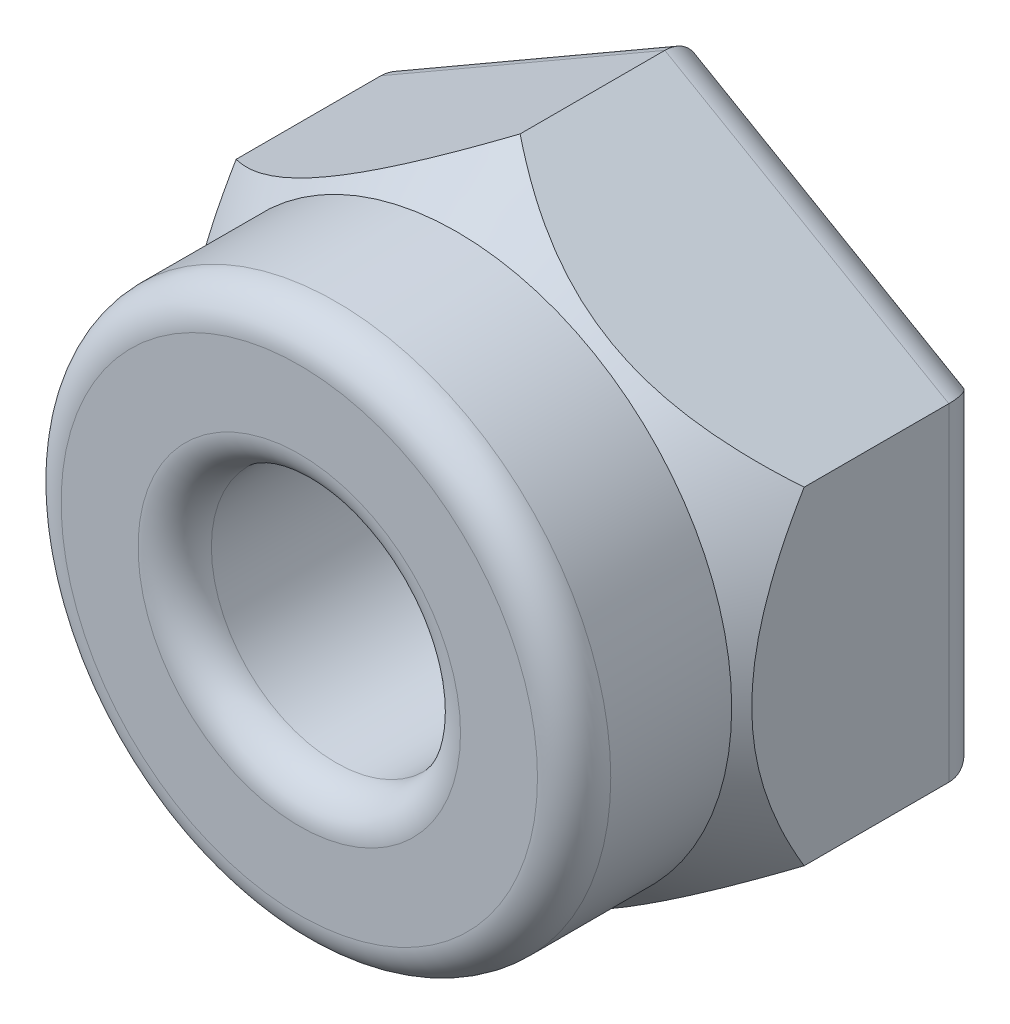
ISO-10303-21;
HEADER;
FILE_DESCRIPTION(('STEP AP214'),'2;1');
FILE_NAME('part.step','',(''),(''),'','','');
FILE_SCHEMA(('AUTOMOTIVE_DESIGN { 1 0 10303 214 1 1 1 1 }'));
ENDSEC;
DATA;
#1=APPLICATION_CONTEXT('core data for automotive mechanical design processes');
#2=APPLICATION_PROTOCOL_DEFINITION('international standard','automotive_design',2000,#1);
#3=PRODUCT_CONTEXT('',#1,'mechanical');
#4=PRODUCT('Part','Part','',(#3));
#5=PRODUCT_RELATED_PRODUCT_CATEGORY('part','',(#4));
#6=PRODUCT_DEFINITION_FORMATION('','',#4);
#7=PRODUCT_DEFINITION_CONTEXT('part definition',#1,'design');
#8=PRODUCT_DEFINITION('design','',#6,#7);
#9=PRODUCT_DEFINITION_SHAPE('','',#8);
#10=(LENGTH_UNIT() NAMED_UNIT(*) SI_UNIT(.MILLI.,.METRE.));
#11=(NAMED_UNIT(*) PLANE_ANGLE_UNIT() SI_UNIT($,.RADIAN.));
#12=(NAMED_UNIT(*) SI_UNIT($,.STERADIAN.) SOLID_ANGLE_UNIT());
#13=UNCERTAINTY_MEASURE_WITH_UNIT(LENGTH_MEASURE(1.E-05),#10,'distance_accuracy_value','');
#14=(GEOMETRIC_REPRESENTATION_CONTEXT(3) GLOBAL_UNCERTAINTY_ASSIGNED_CONTEXT((#13)) GLOBAL_UNIT_ASSIGNED_CONTEXT((#10,
#11,#12)) REPRESENTATION_CONTEXT('',''));
#15=CARTESIAN_POINT('',(0.,0.,0.));
#16=DIRECTION('',(0.,0.,1.));
#17=DIRECTION('',(1.,0.,0.));
#18=AXIS2_PLACEMENT_3D('',#15,#16,#17);
#19=CARTESIAN_POINT('',(-3.937,-2.27302800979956,3.3909));
#20=DIRECTION('',(0.5,0.866025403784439,0.));
#21=DIRECTION('',(-0.866025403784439,0.5,0.));
#22=AXIS2_PLACEMENT_3D('',#19,#20,#21);
#23=PLANE('',#22);
#24=DIRECTION('',(0.,0.,-1.));
#25=VECTOR('',#24,1.);
#26=CARTESIAN_POINT('',(-3.937,-2.27302800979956,3.3909));
#27=LINE('',#26,#25);
#28=CARTESIAN_POINT('',(-3.937,-2.27302800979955,2.51370259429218));
#29=VERTEX_POINT('',#28);
#30=CARTESIAN_POINT('',(-3.937,-2.27302800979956,0.508000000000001));
#31=VERTEX_POINT('',#30);
#32=EDGE_CURVE('E293',#29,#31,#27,.T.);
#33=ORIENTED_EDGE('',*,*,#32,.T.);
#34=DIRECTION('',(0.866025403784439,-0.5,0.));
#35=VECTOR('',#34,1.);
#36=CARTESIAN_POINT('',(-3.937,-2.27302800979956,0.508));
#37=LINE('',#36,#35);
#38=CARTESIAN_POINT('',(0.,-4.54605601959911,0.508000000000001));
#39=VERTEX_POINT('',#38);
#40=EDGE_CURVE('E169',#31,#39,#37,.T.);
#41=ORIENTED_EDGE('',*,*,#40,.T.);
#42=DIRECTION('',(0.,0.,-1.));
#43=VECTOR('',#42,1.);
#44=CARTESIAN_POINT('',(0.,-4.54605601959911,3.3909));
#45=LINE('',#44,#43);
#46=CARTESIAN_POINT('',(0.,-4.54605601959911,2.51370259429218));
#47=VERTEX_POINT('',#46);
#48=EDGE_CURVE('E131',#47,#39,#45,.T.);
#49=ORIENTED_EDGE('',*,*,#48,.F.);
#50=CARTESIAN_POINT('',(-3.9372,-2.27291253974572,2.51356497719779));
#51=CARTESIAN_POINT('',(-3.87918851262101,-2.30640548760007,2.55347726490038));
#52=CARTESIAN_POINT('',(-3.82067869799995,-2.34018614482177,2.59242168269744));
#53=CARTESIAN_POINT('',(-3.70255594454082,-2.40838434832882,2.66808684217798));
#54=CARTESIAN_POINT('',(-3.64294249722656,-2.44280218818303,2.70480652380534));
#55=CARTESIAN_POINT('',(-3.46164394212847,-2.54747495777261,2.8115681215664));
#56=CARTESIAN_POINT('',(-3.33819856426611,-2.61874617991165,2.87772345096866));
#57=CARTESIAN_POINT('',(-3.08604866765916,-2.76432499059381,2.99663685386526));
#58=CARTESIAN_POINT('',(-2.95732934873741,-2.83864112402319,3.04935373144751));
#59=CARTESIAN_POINT('',(-2.69568376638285,-2.98970227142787,3.13717539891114));
#60=CARTESIAN_POINT('',(-2.56276990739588,-3.06644012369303,3.17232773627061));
#61=CARTESIAN_POINT('',(-2.34278920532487,-3.19344604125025,3.21281193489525));
#62=CARTESIAN_POINT('',(-2.25656151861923,-3.24322961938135,3.22433387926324));
#63=CARTESIAN_POINT('',(-2.08352668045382,-3.34313132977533,3.23838043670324));
#64=CARTESIAN_POINT('',(-1.99671943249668,-3.393249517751,3.24090351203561));
#65=CARTESIAN_POINT('',(-1.82373987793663,-3.49311931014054,3.23682077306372));
#66=CARTESIAN_POINT('',(-1.73756667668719,-3.54287143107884,3.23026426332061));
#67=CARTESIAN_POINT('',(-1.56606240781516,-3.64188946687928,3.20843953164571));
#68=CARTESIAN_POINT('',(-1.48073138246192,-3.6911553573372,3.19317087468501));
#69=CARTESIAN_POINT('',(-1.2878830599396,-3.80249638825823,3.14922967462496));
#70=CARTESIAN_POINT('',(-1.18080127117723,-3.86432008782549,3.11800921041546));
#71=CARTESIAN_POINT('',(-0.969571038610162,-3.98627391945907,3.04434777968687));
#72=CARTESIAN_POINT('',(-0.865424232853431,-4.04640310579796,3.00190067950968));
#73=CARTESIAN_POINT('',(-0.659922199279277,-4.16504976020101,2.90762589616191));
#74=CARTESIAN_POINT('',(-0.558579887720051,-4.22355977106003,2.85576116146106));
#75=CARTESIAN_POINT('',(-0.359066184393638,-4.33874906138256,2.74460373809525));
#76=CARTESIAN_POINT('',(-0.260893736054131,-4.39542895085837,2.6853135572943));
#77=CARTESIAN_POINT('',(-0.13650938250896,-4.46724229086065,2.60525001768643));
#78=CARTESIAN_POINT('',(-0.108958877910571,-4.48314858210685,2.58719701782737));
#79=CARTESIAN_POINT('',(-0.0541697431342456,-4.51478110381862,2.55068819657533));
#80=CARTESIAN_POINT('',(-0.0269304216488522,-4.53050773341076,2.53223375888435));
#81=CARTESIAN_POINT('',(0.000200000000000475,-4.54617148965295,2.51356497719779));
#82=B_SPLINE_CURVE_WITH_KNOTS('',3,(#50,#51,#52,#53,#54,#55,#56,#57,#58,#59,#60,#61,#62,#63,#64,
#65,#66,#67,#68,#69,#70,#71,#72,#73,#74,#75,#76,#77,#78,#79,#80,#81),.UNSPECIFIED.,.F.,.F.,(4,2,
2,2,2,2,2,2,2,2,2,2,2,2,2,4),(0.,0.233909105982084,0.467928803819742,0.93879039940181,
1.4110785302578,1.88208114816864,2.18241072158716,2.48279161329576,2.78154773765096,
3.08031878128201,3.4622494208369,3.84438916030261,4.22806626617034,4.61161413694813,
4.72134645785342,4.83074684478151),.UNSPECIFIED.);
#83=EDGE_CURVE('E236',#29,#47,#82,.T.);
#84=ORIENTED_EDGE('',*,*,#83,.F.);
#85=EDGE_LOOP('',(#33,#41,#49,#84));
#86=FACE_BOUND('',#85,.T.);
#87=ADVANCED_FACE('F32',(#86),#23,.F.);
#88=CARTESIAN_POINT('',(0.,-4.54605601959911,3.3909));
#89=DIRECTION('',(-0.5,0.866025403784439,0.));
#90=DIRECTION('',(-0.866025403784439,-0.5,0.));
#91=AXIS2_PLACEMENT_3D('',#88,#89,#90);
#92=PLANE('',#91);
#93=ORIENTED_EDGE('',*,*,#48,.T.);
#94=DIRECTION('',(0.866025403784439,0.5,0.));
#95=VECTOR('',#94,1.);
#96=CARTESIAN_POINT('',(0.,-4.54605601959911,0.508));
#97=LINE('',#96,#95);
#98=CARTESIAN_POINT('',(3.937,-2.27302800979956,0.508000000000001));
#99=VERTEX_POINT('',#98);
#100=EDGE_CURVE('E167',#39,#99,#97,.T.);
#101=ORIENTED_EDGE('',*,*,#100,.T.);
#102=DIRECTION('',(0.,0.,-1.));
#103=VECTOR('',#102,1.);
#104=CARTESIAN_POINT('',(3.937,-2.27302800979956,3.3909));
#105=LINE('',#104,#103);
#106=CARTESIAN_POINT('',(3.937,-2.27302800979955,2.51370259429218));
#107=VERTEX_POINT('',#106);
#108=EDGE_CURVE('E129',#107,#99,#105,.T.);
#109=ORIENTED_EDGE('',*,*,#108,.F.);
#110=CARTESIAN_POINT('',(-0.000200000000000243,-4.54617148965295,2.51356497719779));
#111=CARTESIAN_POINT('',(0.0578114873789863,-4.5126785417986,2.55347726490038));
#112=CARTESIAN_POINT('',(0.116321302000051,-4.4788978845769,2.59242168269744));
#113=CARTESIAN_POINT('',(0.234444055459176,-4.41069968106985,2.66808684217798));
#114=CARTESIAN_POINT('',(0.294057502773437,-4.37628184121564,2.70480652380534));
#115=CARTESIAN_POINT('',(0.475356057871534,-4.27160907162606,2.8115681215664));
#116=CARTESIAN_POINT('',(0.598801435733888,-4.20033784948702,2.87772345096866));
#117=CARTESIAN_POINT('',(0.850951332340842,-4.05475903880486,2.99663685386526));
#118=CARTESIAN_POINT('',(0.979670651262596,-3.98044290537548,3.04935373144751));
#119=CARTESIAN_POINT('',(1.24131623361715,-3.8293817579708,3.13717539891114));
#120=CARTESIAN_POINT('',(1.37423009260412,-3.75264390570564,3.17232773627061));
#121=CARTESIAN_POINT('',(1.59421079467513,-3.62563798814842,3.21281193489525));
#122=CARTESIAN_POINT('',(1.68043848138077,-3.57585441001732,3.22433387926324));
#123=CARTESIAN_POINT('',(1.85347331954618,-3.47595269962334,3.23838043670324));
#124=CARTESIAN_POINT('',(1.94028056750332,-3.42583451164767,3.24090351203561));
#125=CARTESIAN_POINT('',(2.11326012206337,-3.32596471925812,3.23682077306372));
#126=CARTESIAN_POINT('',(2.19943332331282,-3.27621259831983,3.23026426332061));
#127=CARTESIAN_POINT('',(2.37093759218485,-3.17719456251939,3.20843953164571));
#128=CARTESIAN_POINT('',(2.45626861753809,-3.12792867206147,3.19317087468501));
#129=CARTESIAN_POINT('',(2.64911694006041,-3.01658764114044,3.14922967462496));
#130=CARTESIAN_POINT('',(2.75619872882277,-2.95476394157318,3.11800921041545));
#131=CARTESIAN_POINT('',(2.96742896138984,-2.8328101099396,3.04434777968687));
#132=CARTESIAN_POINT('',(3.07157576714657,-2.77268092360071,3.00190067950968));
#133=CARTESIAN_POINT('',(3.27707780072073,-2.65403426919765,2.9076258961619));
#134=CARTESIAN_POINT('',(3.37842011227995,-2.59552425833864,2.85576116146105));
#135=CARTESIAN_POINT('',(3.57793381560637,-2.48033496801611,2.74460373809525));
#136=CARTESIAN_POINT('',(3.67610626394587,-2.42365507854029,2.68531355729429));
#137=CARTESIAN_POINT('',(3.80049061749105,-2.35184173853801,2.60525001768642));
#138=CARTESIAN_POINT('',(3.82804112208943,-2.33593544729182,2.58719701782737));
#139=CARTESIAN_POINT('',(3.88283025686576,-2.30430292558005,2.55068819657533));
#140=CARTESIAN_POINT('',(3.91006957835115,-2.28857629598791,2.53223375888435));
#141=CARTESIAN_POINT('',(3.9372,-2.27291253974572,2.51356497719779));
#142=B_SPLINE_CURVE_WITH_KNOTS('',3,(#110,#111,#112,#113,#114,#115,#116,#117,#118,#119,#120,
#121,#122,#123,#124,#125,#126,#127,#128,#129,#130,#131,#132,#133,#134,#135,#136,#137,#138,#139,
#140,#141),.UNSPECIFIED.,.F.,.F.,(4,2,2,2,2,2,2,2,2,2,2,2,2,2,2,4),(0.,0.233909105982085,
0.467928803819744,0.938790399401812,1.4110785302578,1.88208114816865,2.18241072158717,
2.48279161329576,2.78154773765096,3.08031878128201,3.46224942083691,3.84438916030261,
4.22806626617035,4.61161413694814,4.72134645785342,4.83074684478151),.UNSPECIFIED.);
#143=EDGE_CURVE('E110',#47,#107,#142,.T.);
#144=ORIENTED_EDGE('',*,*,#143,.F.);
#145=EDGE_LOOP('',(#93,#101,#109,#144));
#146=FACE_BOUND('',#145,.T.);
#147=ADVANCED_FACE('F242',(#146),#92,.F.);
#148=CARTESIAN_POINT('',(3.937,-2.27302800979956,3.3909));
#149=DIRECTION('',(-1.,0.,0.));
#150=DIRECTION('',(0.,-1.,0.));
#151=AXIS2_PLACEMENT_3D('',#148,#149,#150);
#152=PLANE('',#151);
#153=ORIENTED_EDGE('',*,*,#108,.T.);
#154=DIRECTION('',(0.,1.,0.));
#155=VECTOR('',#154,1.);
#156=CARTESIAN_POINT('',(3.937,-2.27302800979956,0.508));
#157=LINE('',#156,#155);
#158=CARTESIAN_POINT('',(3.937,2.27302800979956,0.508000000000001));
#159=VERTEX_POINT('',#158);
#160=EDGE_CURVE('E128',#99,#159,#157,.T.);
#161=ORIENTED_EDGE('',*,*,#160,.T.);
#162=DIRECTION('',(0.,0.,-1.));
#163=VECTOR('',#162,1.);
#164=CARTESIAN_POINT('',(3.937,2.27302800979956,3.3909));
#165=LINE('',#164,#163);
#166=CARTESIAN_POINT('',(3.937,2.27302800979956,2.51370259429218));
#167=VERTEX_POINT('',#166);
#168=EDGE_CURVE('E121',#167,#159,#165,.T.);
#169=ORIENTED_EDGE('',*,*,#168,.F.);
#170=CARTESIAN_POINT('',(3.937,-4.38232958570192,0.910769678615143));
#171=CARTESIAN_POINT('',(3.937,-4.28110504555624,1.00048905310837));
#172=CARTESIAN_POINT('',(3.937,-4.17920445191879,1.0894576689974));
#173=CARTESIAN_POINT('',(3.937,-3.97378600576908,1.26556104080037));
#174=CARTESIAN_POINT('',(3.937,-3.87026773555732,1.35269530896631));
#175=CARTESIAN_POINT('',(3.937,-3.66051466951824,1.5254808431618));
#176=CARTESIAN_POINT('',(3.937,-3.55426426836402,1.61111322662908));
#177=CARTESIAN_POINT('',(3.937,-3.3396106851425,1.77962607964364));
#178=CARTESIAN_POINT('',(3.937,-3.23120767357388,1.86250676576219));
#179=CARTESIAN_POINT('',(3.937,-3.00583163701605,2.0293805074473));
#180=CARTESIAN_POINT('',(3.937,-2.88871605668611,2.11318194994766));
#181=CARTESIAN_POINT('',(3.937,-2.65119566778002,2.27606491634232));
#182=CARTESIAN_POINT('',(3.937,-2.53079025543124,2.35514556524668));
#183=CARTESIAN_POINT('',(3.937,-2.28661810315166,2.50700159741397));
#184=CARTESIAN_POINT('',(3.937,-2.16286442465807,2.5797978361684));
#185=CARTESIAN_POINT('',(3.937,-1.91114515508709,2.71765022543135));
#186=CARTESIAN_POINT('',(3.937,-1.78318176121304,2.78271033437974));
#187=CARTESIAN_POINT('',(3.937,-1.55259415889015,2.88908573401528));
#188=CARTESIAN_POINT('',(3.937,-1.45090639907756,2.93242153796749));
#189=CARTESIAN_POINT('',(3.937,-1.24473804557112,3.01200196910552));
#190=CARTESIAN_POINT('',(3.937,-1.14025690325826,3.04824519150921));
#191=CARTESIAN_POINT('',(3.937,-0.929886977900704,3.11195665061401));
#192=CARTESIAN_POINT('',(3.937,-0.824026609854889,3.13951764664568));
#193=CARTESIAN_POINT('',(3.937,-0.610289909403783,3.18516089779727));
#194=CARTESIAN_POINT('',(3.937,-0.502414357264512,3.20324674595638));
#195=CARTESIAN_POINT('',(3.937,-0.296211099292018,3.22771330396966));
#196=CARTESIAN_POINT('',(3.937,-0.198000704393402,3.23507916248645));
#197=CARTESIAN_POINT('',(3.937,-0.00131887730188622,3.24100940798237));
#198=CARTESIAN_POINT('',(3.937,0.0971525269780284,3.23957470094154));
#199=CARTESIAN_POINT('',(3.937,0.293719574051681,3.22796507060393));
#200=CARTESIAN_POINT('',(3.937,0.391814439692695,3.21777714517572));
#201=CARTESIAN_POINT('',(3.937,0.586785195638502,3.18912300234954));
#202=CARTESIAN_POINT('',(3.937,0.683660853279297,3.17065522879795));
#203=CARTESIAN_POINT('',(3.937,0.909258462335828,3.11842402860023));
#204=CARTESIAN_POINT('',(3.937,1.03726526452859,3.08156981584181));
#205=CARTESIAN_POINT('',(3.937,1.28940495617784,2.99643001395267));
#206=CARTESIAN_POINT('',(3.937,1.41353583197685,2.94813859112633));
#207=CARTESIAN_POINT('',(3.937,1.65921843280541,2.84174251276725));
#208=CARTESIAN_POINT('',(3.937,1.78072222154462,2.78352844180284));
#209=CARTESIAN_POINT('',(3.937,2.01978909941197,2.65967919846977));
#210=CARTESIAN_POINT('',(3.937,2.13735347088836,2.59404647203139));
#211=CARTESIAN_POINT('',(3.937,2.45451019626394,2.40632688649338));
#212=CARTESIAN_POINT('',(3.937,2.65059217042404,2.2783305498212));
#213=CARTESIAN_POINT('',(3.937,3.03453811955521,2.01046582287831));
#214=CARTESIAN_POINT('',(3.937,3.22239486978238,1.87058730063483));
#215=CARTESIAN_POINT('',(3.937,3.59241411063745,1.5820195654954));
#216=CARTESIAN_POINT('',(3.937,3.77455000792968,1.43329648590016));
#217=CARTESIAN_POINT('',(3.937,4.13371229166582,1.12996871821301));
#218=CARTESIAN_POINT('',(3.937,4.31074040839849,0.975366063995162));
#219=CARTESIAN_POINT('',(3.937,4.64640032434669,0.67470923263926));
#220=CARTESIAN_POINT('',(3.937,4.80534467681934,0.529002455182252));
#221=CARTESIAN_POINT('',(3.937,5.12055889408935,0.234698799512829));
#222=CARTESIAN_POINT('',(3.937,5.2768284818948,0.086101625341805));
#223=CARTESIAN_POINT('',(3.937,5.58573347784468,-0.211975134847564));
#224=CARTESIAN_POINT('',(3.937,5.73838914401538,-0.361433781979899));
#225=CARTESIAN_POINT('',(3.937,6.04186681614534,-0.662138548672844));
#226=CARTESIAN_POINT('',(3.937,6.19268920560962,-0.813384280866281));
#227=CARTESIAN_POINT('',(3.937,6.34278835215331,-0.965335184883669));
#228=B_SPLINE_CURVE_WITH_KNOTS('',3,(#170,#171,#172,#173,#174,#175,#176,#177,#178,#179,#180,
#181,#182,#183,#184,#185,#186,#187,#188,#189,#190,#191,#192,#193,#194,#195,#196,#197,#198,#199,
#200,#201,#202,#203,#204,#205,#206,#207,#208,#209,#210,#211,#212,#213,#214,#215,#216,#217,#218,
#219,#220,#221,#222,#223,#224,#225,#226,#227),.UNSPECIFIED.,.F.,.F.,(4,2,2,2,2,2,2,2,2,2,2,2,2,
2,2,2,2,2,2,2,2,2,2,2,2,2,2,2,4),(0.,0.405795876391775,0.81169832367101,1.22104842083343,
1.6303662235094,2.06230254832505,2.49431868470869,2.92484109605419,3.35514226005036,
3.68653582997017,4.0179949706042,4.34578229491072,4.67344522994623,4.96852422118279,
5.26357283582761,5.55906047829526,5.85460367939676,6.25353836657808,6.65267697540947,
7.05654122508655,7.46027270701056,8.16202993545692,8.86439167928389,9.56964174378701,
10.2746500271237,10.9214791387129,11.5683748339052,12.2092756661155,12.8500400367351),.UNSPECIFIED.);
#229=EDGE_CURVE('E104',#107,#167,#228,.T.);
#230=ORIENTED_EDGE('',*,*,#229,.F.);
#231=EDGE_LOOP('',(#153,#161,#169,#230));
#232=FACE_BOUND('',#231,.T.);
#233=ADVANCED_FACE('F126',(#232),#152,.F.);
#234=CARTESIAN_POINT('',(3.937,2.27302800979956,3.3909));
#235=DIRECTION('',(-0.5,-0.866025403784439,0.));
#236=DIRECTION('',(0.866025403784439,-0.5,0.));
#237=AXIS2_PLACEMENT_3D('',#234,#235,#236);
#238=PLANE('',#237);
#239=ORIENTED_EDGE('',*,*,#168,.T.);
#240=DIRECTION('',(-0.866025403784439,0.5,0.));
#241=VECTOR('',#240,1.);
#242=CARTESIAN_POINT('',(3.937,2.27302800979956,0.508));
#243=LINE('',#242,#241);
#244=CARTESIAN_POINT('',(0.,4.54605601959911,0.508000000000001));
#245=VERTEX_POINT('',#244);
#246=EDGE_CURVE('E151',#159,#245,#243,.T.);
#247=ORIENTED_EDGE('',*,*,#246,.T.);
#248=DIRECTION('',(0.,0.,-1.));
#249=VECTOR('',#248,1.);
#250=CARTESIAN_POINT('',(0.,4.54605601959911,3.3909));
#251=LINE('',#250,#249);
#252=CARTESIAN_POINT('',(0.,4.54605601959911,2.51370259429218));
#253=VERTEX_POINT('',#252);
#254=EDGE_CURVE('E123',#253,#245,#251,.T.);
#255=ORIENTED_EDGE('',*,*,#254,.F.);
#256=CARTESIAN_POINT('',(3.9372,2.27291253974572,2.51356497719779));
#257=CARTESIAN_POINT('',(3.87918851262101,2.30640548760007,2.55347726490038));
#258=CARTESIAN_POINT('',(3.82067869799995,2.34018614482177,2.59242168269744));
#259=CARTESIAN_POINT('',(3.70255594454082,2.40838434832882,2.66808684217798));
#260=CARTESIAN_POINT('',(3.64294249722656,2.44280218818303,2.70480652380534));
#261=CARTESIAN_POINT('',(3.46164394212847,2.54747495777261,2.8115681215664));
#262=CARTESIAN_POINT('',(3.33819856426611,2.61874617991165,2.87772345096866));
#263=CARTESIAN_POINT('',(3.08604866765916,2.76432499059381,2.99663685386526));
#264=CARTESIAN_POINT('',(2.9573293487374,2.83864112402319,3.04935373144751));
#265=CARTESIAN_POINT('',(2.69568376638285,2.98970227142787,3.13717539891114));
#266=CARTESIAN_POINT('',(2.56276990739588,3.06644012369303,3.17232773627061));
#267=CARTESIAN_POINT('',(2.34278920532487,3.19344604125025,3.21281193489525));
#268=CARTESIAN_POINT('',(2.25656151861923,3.24322961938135,3.22433387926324));
#269=CARTESIAN_POINT('',(2.08352668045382,3.34313132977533,3.23838043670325));
#270=CARTESIAN_POINT('',(1.99671943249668,3.393249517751,3.24090351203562));
#271=CARTESIAN_POINT('',(1.82373987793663,3.49311931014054,3.23682077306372));
#272=CARTESIAN_POINT('',(1.73756667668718,3.54287143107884,3.23026426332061));
#273=CARTESIAN_POINT('',(1.56606240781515,3.64188946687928,3.20843953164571));
#274=CARTESIAN_POINT('',(1.48073138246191,3.6911553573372,3.19317087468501));
#275=CARTESIAN_POINT('',(1.28788305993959,3.80249638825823,3.14922967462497));
#276=CARTESIAN_POINT('',(1.18080127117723,3.86432008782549,3.11800921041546));
#277=CARTESIAN_POINT('',(0.969571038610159,3.98627391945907,3.04434777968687));
#278=CARTESIAN_POINT('',(0.865424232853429,4.04640310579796,3.00190067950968));
#279=CARTESIAN_POINT('',(0.659922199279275,4.16504976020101,2.90762589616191));
#280=CARTESIAN_POINT('',(0.558579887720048,4.22355977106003,2.85576116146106));
#281=CARTESIAN_POINT('',(0.359066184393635,4.33874906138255,2.74460373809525));
#282=CARTESIAN_POINT('',(0.260893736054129,4.39542895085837,2.6853135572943));
#283=CARTESIAN_POINT('',(0.136509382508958,4.46724229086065,2.60525001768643));
#284=CARTESIAN_POINT('',(0.108958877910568,4.48314858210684,2.58719701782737));
#285=CARTESIAN_POINT('',(0.0541697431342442,4.51478110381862,2.55068819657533));
#286=CARTESIAN_POINT('',(0.0269304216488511,4.53050773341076,2.53223375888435));
#287=CARTESIAN_POINT('',(-0.000200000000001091,4.54617148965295,2.51356497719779));
#288=B_SPLINE_CURVE_WITH_KNOTS('',3,(#256,#257,#258,#259,#260,#261,#262,#263,#264,#265,#266,
#267,#268,#269,#270,#271,#272,#273,#274,#275,#276,#277,#278,#279,#280,#281,#282,#283,#284,#285,
#286,#287),.UNSPECIFIED.,.F.,.F.,(4,2,2,2,2,2,2,2,2,2,2,2,2,2,2,4),(0.,0.233909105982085,
0.467928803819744,0.938790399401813,1.4110785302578,1.88208114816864,2.18241072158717,
2.48279161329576,2.78154773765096,3.08031878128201,3.4622494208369,3.84438916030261,
4.22806626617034,4.61161413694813,4.72134645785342,4.83074684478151),.UNSPECIFIED.);
#289=EDGE_CURVE('E107',#167,#253,#288,.T.);
#290=ORIENTED_EDGE('',*,*,#289,.F.);
#291=EDGE_LOOP('',(#239,#247,#255,#290));
#292=FACE_BOUND('',#291,.T.);
#293=ADVANCED_FACE('F119',(#292),#238,.F.);
#294=CARTESIAN_POINT('',(0.,4.54605601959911,3.3909));
#295=DIRECTION('',(0.5,-0.866025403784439,0.));
#296=DIRECTION('',(0.866025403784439,0.5,0.));
#297=AXIS2_PLACEMENT_3D('',#294,#295,#296);
#298=PLANE('',#297);
#299=ORIENTED_EDGE('',*,*,#254,.T.);
#300=DIRECTION('',(-0.866025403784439,-0.5,0.));
#301=VECTOR('',#300,1.);
#302=CARTESIAN_POINT('',(0.,4.54605601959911,0.508));
#303=LINE('',#302,#301);
#304=CARTESIAN_POINT('',(-3.937,2.27302800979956,0.508000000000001));
#305=VERTEX_POINT('',#304);
#306=EDGE_CURVE('E11',#245,#305,#303,.T.);
#307=ORIENTED_EDGE('',*,*,#306,.T.);
#308=DIRECTION('',(0.,0.,-1.));
#309=VECTOR('',#308,1.);
#310=CARTESIAN_POINT('',(-3.937,2.27302800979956,3.3909));
#311=LINE('',#310,#309);
#312=CARTESIAN_POINT('',(-3.937,2.27302800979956,2.51370259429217));
#313=VERTEX_POINT('',#312);
#314=EDGE_CURVE('E133',#313,#305,#311,.T.);
#315=ORIENTED_EDGE('',*,*,#314,.F.);
#316=CARTESIAN_POINT('',(0.000199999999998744,4.54617148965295,2.51356497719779));
#317=CARTESIAN_POINT('',(-0.0578114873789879,4.5126785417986,2.55347726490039));
#318=CARTESIAN_POINT('',(-0.116321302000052,4.47889788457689,2.59242168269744));
#319=CARTESIAN_POINT('',(-0.234444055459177,4.41069968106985,2.66808684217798));
#320=CARTESIAN_POINT('',(-0.294057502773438,4.37628184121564,2.70480652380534));
#321=CARTESIAN_POINT('',(-0.475356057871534,4.27160907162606,2.8115681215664));
#322=CARTESIAN_POINT('',(-0.598801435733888,4.20033784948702,2.87772345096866));
#323=CARTESIAN_POINT('',(-0.850951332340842,4.05475903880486,2.99663685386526));
#324=CARTESIAN_POINT('',(-0.979670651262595,3.98044290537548,3.04935373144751));
#325=CARTESIAN_POINT('',(-1.24131623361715,3.8293817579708,3.13717539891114));
#326=CARTESIAN_POINT('',(-1.37423009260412,3.75264390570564,3.17232773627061));
#327=CARTESIAN_POINT('',(-1.59421079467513,3.62563798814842,3.21281193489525));
#328=CARTESIAN_POINT('',(-1.68043848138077,3.57585441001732,3.22433387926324));
#329=CARTESIAN_POINT('',(-1.85347331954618,3.47595269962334,3.23838043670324));
#330=CARTESIAN_POINT('',(-1.94028056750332,3.42583451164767,3.24090351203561));
#331=CARTESIAN_POINT('',(-2.11326012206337,3.32596471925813,3.23682077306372));
#332=CARTESIAN_POINT('',(-2.19943332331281,3.27621259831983,3.23026426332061));
#333=CARTESIAN_POINT('',(-2.37093759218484,3.17719456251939,3.20843953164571));
#334=CARTESIAN_POINT('',(-2.45626861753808,3.12792867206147,3.19317087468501));
#335=CARTESIAN_POINT('',(-2.6491169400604,3.01658764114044,3.14922967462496));
#336=CARTESIAN_POINT('',(-2.75619872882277,2.95476394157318,3.11800921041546));
#337=CARTESIAN_POINT('',(-2.96742896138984,2.8328101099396,3.04434777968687));
#338=CARTESIAN_POINT('',(-3.07157576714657,2.77268092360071,3.00190067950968));
#339=CARTESIAN_POINT('',(-3.27707780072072,2.65403426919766,2.90762589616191));
#340=CARTESIAN_POINT('',(-3.37842011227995,2.59552425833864,2.85576116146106));
#341=CARTESIAN_POINT('',(-3.57793381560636,2.48033496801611,2.74460373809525));
#342=CARTESIAN_POINT('',(-3.67610626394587,2.4236550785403,2.6853135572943));
#343=CARTESIAN_POINT('',(-3.80049061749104,2.35184173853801,2.60525001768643));
#344=CARTESIAN_POINT('',(-3.82804112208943,2.33593544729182,2.58719701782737));
#345=CARTESIAN_POINT('',(-3.88283025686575,2.30430292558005,2.55068819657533));
#346=CARTESIAN_POINT('',(-3.91006957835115,2.28857629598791,2.53223375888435));
#347=CARTESIAN_POINT('',(-3.9372,2.27291253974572,2.51356497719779));
#348=B_SPLINE_CURVE_WITH_KNOTS('',3,(#316,#317,#318,#319,#320,#321,#322,#323,#324,#325,#326,
#327,#328,#329,#330,#331,#332,#333,#334,#335,#336,#337,#338,#339,#340,#341,#342,#343,#344,#345,
#346,#347),.UNSPECIFIED.,.F.,.F.,(4,2,2,2,2,2,2,2,2,2,2,2,2,2,2,4),(0.,0.233909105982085,
0.467928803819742,0.938790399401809,1.4110785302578,1.88208114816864,2.18241072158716,
2.48279161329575,2.78154773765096,3.08031878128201,3.4622494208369,3.84438916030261,
4.22806626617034,4.61161413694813,4.72134645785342,4.83074684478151),.UNSPECIFIED.);
#349=EDGE_CURVE('E124',#253,#313,#348,.T.);
#350=ORIENTED_EDGE('',*,*,#349,.F.);
#351=EDGE_LOOP('',(#299,#307,#315,#350));
#352=FACE_BOUND('',#351,.T.);
#353=ADVANCED_FACE('F215',(#352),#298,.F.);
#354=CARTESIAN_POINT('',(-3.937,2.27302800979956,3.3909));
#355=DIRECTION('',(1.,0.,0.));
#356=DIRECTION('',(0.,0.,-1.));
#357=AXIS2_PLACEMENT_3D('',#354,#355,#356);
#358=PLANE('',#357);
#359=ORIENTED_EDGE('',*,*,#314,.T.);
#360=DIRECTION('',(0.,-1.,0.));
#361=VECTOR('',#360,1.);
#362=CARTESIAN_POINT('',(-3.937,2.27302800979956,0.508));
#363=LINE('',#362,#361);
#364=EDGE_CURVE('E41',#305,#31,#363,.T.);
#365=ORIENTED_EDGE('',*,*,#364,.T.);
#366=ORIENTED_EDGE('',*,*,#32,.F.);
#367=CARTESIAN_POINT('',(-3.937,-4.382329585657,0.91076967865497));
#368=CARTESIAN_POINT('',(-3.937,-4.28110504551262,1.00048905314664));
#369=CARTESIAN_POINT('',(-3.937,-4.17920445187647,1.0894576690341));
#370=CARTESIAN_POINT('',(-3.937,-3.97378600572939,1.26556104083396));
#371=CARTESIAN_POINT('',(-3.937,-3.87026773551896,1.35269530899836));
#372=CARTESIAN_POINT('',(-3.937,-3.66051466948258,1.52548084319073));
#373=CARTESIAN_POINT('',(-3.937,-3.55426426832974,1.61111322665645));
#374=CARTESIAN_POINT('',(-3.937,-3.339610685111,1.77962607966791));
#375=CARTESIAN_POINT('',(-3.937,-3.23120767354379,1.86250676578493));
#376=CARTESIAN_POINT('',(-3.937,-3.0058316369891,2.02938050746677));
#377=CARTESIAN_POINT('',(-3.937,-2.88871605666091,2.1131819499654));
#378=CARTESIAN_POINT('',(-3.937,-2.65119566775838,2.2760649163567));
#379=CARTESIAN_POINT('',(-3.937,-2.53079025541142,2.35514556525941));
#380=CARTESIAN_POINT('',(-3.937,-2.28661810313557,2.50700159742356));
#381=CARTESIAN_POINT('',(-3.937,-2.16286442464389,2.57979783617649));
#382=CARTESIAN_POINT('',(-3.937,-1.91114515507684,2.71765022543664));
#383=CARTESIAN_POINT('',(-3.937,-1.78318176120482,2.78271033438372));
#384=CARTESIAN_POINT('',(-3.937,-1.55259415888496,2.88908573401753));
#385=CARTESIAN_POINT('',(-3.937,-1.45090639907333,2.93242153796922));
#386=CARTESIAN_POINT('',(-3.937,-1.24473804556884,3.01200196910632));
#387=CARTESIAN_POINT('',(-3.937,-1.14025690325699,3.0482451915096));
#388=CARTESIAN_POINT('',(-3.937,-0.929886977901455,3.11195665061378));
#389=CARTESIAN_POINT('',(-3.937,-0.824026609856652,3.13951764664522));
#390=CARTESIAN_POINT('',(-3.937,-0.610289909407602,3.18516089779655));
#391=CARTESIAN_POINT('',(-3.937,-0.502414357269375,3.20324674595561));
#392=CARTESIAN_POINT('',(-3.937,-0.296211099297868,3.22771330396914));
#393=CARTESIAN_POINT('',(-3.937,-0.198000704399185,3.2350791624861));
#394=CARTESIAN_POINT('',(-3.937,-0.0013188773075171,3.24100940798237));
#395=CARTESIAN_POINT('',(-3.937,0.0971525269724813,3.2395747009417));
#396=CARTESIAN_POINT('',(-3.937,0.293719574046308,3.22796507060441));
#397=CARTESIAN_POINT('',(-3.937,0.391814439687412,3.21777714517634));
#398=CARTESIAN_POINT('',(-3.937,0.586785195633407,3.18912300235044));
#399=CARTESIAN_POINT('',(-3.937,0.683660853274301,3.17065522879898));
#400=CARTESIAN_POINT('',(-3.937,0.909258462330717,3.1184240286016));
#401=CARTESIAN_POINT('',(-3.937,1.03726526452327,3.08156981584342));
#402=CARTESIAN_POINT('',(-3.937,1.28940495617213,2.99643001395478));
#403=CARTESIAN_POINT('',(-3.937,1.41353583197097,2.9481385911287));
#404=CARTESIAN_POINT('',(-3.937,1.65921843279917,2.84174251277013));
#405=CARTESIAN_POINT('',(-3.937,1.78072222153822,2.78352844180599));
#406=CARTESIAN_POINT('',(-3.937,2.01978909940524,2.65967919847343));
#407=CARTESIAN_POINT('',(-3.937,2.13735347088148,2.59404647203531));
#408=CARTESIAN_POINT('',(-3.937,2.45451019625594,2.4063268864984));
#409=CARTESIAN_POINT('',(-3.937,2.65059217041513,2.27833054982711));
#410=CARTESIAN_POINT('',(-3.937,3.03453811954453,2.01046582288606));
#411=CARTESIAN_POINT('',(-3.937,3.22239486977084,1.87058730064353));
#412=CARTESIAN_POINT('',(-3.937,3.59241411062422,1.58201956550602));
#413=CARTESIAN_POINT('',(-3.937,3.77455000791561,1.43329648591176));
#414=CARTESIAN_POINT('',(-3.937,4.1337122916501,1.12996871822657));
#415=CARTESIAN_POINT('',(-3.937,4.31074040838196,0.975366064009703));
#416=CARTESIAN_POINT('',(-3.937,4.64640032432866,0.674709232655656));
#417=CARTESIAN_POINT('',(-3.937,4.80534467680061,0.529002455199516));
#418=CARTESIAN_POINT('',(-3.937,5.12055889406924,0.234698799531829));
#419=CARTESIAN_POINT('',(-3.937,5.276828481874,0.0861016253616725));
#420=CARTESIAN_POINT('',(-3.937,5.58573347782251,-0.21197513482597));
#421=CARTESIAN_POINT('',(-3.937,5.73838914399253,-0.361433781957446));
#422=CARTESIAN_POINT('',(-3.937,6.04186681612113,-0.662138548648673));
#423=CARTESIAN_POINT('',(-3.937,6.19268920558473,-0.813384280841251));
#424=CARTESIAN_POINT('',(-3.937,6.34278835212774,-0.96533518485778));
#425=B_SPLINE_CURVE_WITH_KNOTS('',3,(#367,#368,#369,#370,#371,#372,#373,#374,#375,#376,#377,
#378,#379,#380,#381,#382,#383,#384,#385,#386,#387,#388,#389,#390,#391,#392,#393,#394,#395,#396,
#397,#398,#399,#400,#401,#402,#403,#404,#405,#406,#407,#408,#409,#410,#411,#412,#413,#414,#415,
#416,#417,#418,#419,#420,#421,#422,#423,#424),.UNSPECIFIED.,.F.,.F.,(4,2,2,2,2,2,2,2,2,2,2,2,2,
2,2,2,2,2,2,2,2,2,2,2,2,2,2,2,4),(0.,0.405795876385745,0.81169832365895,1.22104842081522,
1.63036622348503,2.06230254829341,2.49431868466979,2.92484109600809,3.35514225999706,
3.68653582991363,4.01799497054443,4.34578229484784,4.67344522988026,4.96852422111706,
5.26357283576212,5.55906047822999,5.85460367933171,6.25353836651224,6.65267697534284,
7.05654122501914,7.46027270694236,8.16202993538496,8.86439167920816,9.5696417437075,
10.2746500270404,10.9214791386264,11.5683748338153,12.2092756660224,12.8500400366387),.UNSPECIFIED.);
#426=EDGE_CURVE('E193',#313,#29,#425,.F.);
#427=ORIENTED_EDGE('',*,*,#426,.F.);
#428=EDGE_LOOP('',(#359,#365,#366,#427));
#429=FACE_BOUND('',#428,.T.);
#430=ADVANCED_FACE('F210',(#429),#358,.F.);
#431=CARTESIAN_POINT('',(3.937,-6.81908402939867,0.));
#432=DIRECTION('',(0.,0.,1.));
#433=DIRECTION('',(1.,0.,0.));
#434=AXIS2_PLACEMENT_3D('',#431,#432,#433);
#435=PLANE('',#434);
#436=DIRECTION('',(-0.866025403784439,-0.5,0.));
#437=VECTOR('',#436,1.);
#438=CARTESIAN_POINT('',(-1.7145,2.96960110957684,0.));
#439=LINE('',#438,#437);
#440=CARTESIAN_POINT('',(-3.429,1.97973407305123,0.));
#441=VERTEX_POINT('',#440);
#442=CARTESIAN_POINT('',(0.,3.95946814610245,0.));
#443=VERTEX_POINT('',#442);
#444=EDGE_CURVE('E153',#441,#443,#439,.F.);
#445=ORIENTED_EDGE('',*,*,#444,.T.);
#446=DIRECTION('',(-0.866025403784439,0.5,0.));
#447=VECTOR('',#446,1.);
#448=CARTESIAN_POINT('',(7.62,-0.439940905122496,0.));
#449=LINE('',#448,#447);
#450=CARTESIAN_POINT('',(3.429,1.97973407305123,0.));
#451=VERTEX_POINT('',#450);
#452=EDGE_CURVE('E163',#443,#451,#449,.F.);
#453=ORIENTED_EDGE('',*,*,#452,.T.);
#454=DIRECTION('',(0.,1.,0.));
#455=VECTOR('',#454,1.);
#456=CARTESIAN_POINT('',(3.429,-6.81908402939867,0.));
#457=LINE('',#456,#455);
#458=CARTESIAN_POINT('',(3.429,-1.97973407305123,0.));
#459=VERTEX_POINT('',#458);
#460=EDGE_CURVE('E161',#451,#459,#457,.F.);
#461=ORIENTED_EDGE('',*,*,#460,.T.);
#462=DIRECTION('',(0.866025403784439,0.5,0.));
#463=VECTOR('',#462,1.);
#464=CARTESIAN_POINT('',(1.7145,-2.96960110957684,0.));
#465=LINE('',#464,#463);
#466=CARTESIAN_POINT('',(0.,-3.95946814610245,0.));
#467=VERTEX_POINT('',#466);
#468=EDGE_CURVE('E159',#459,#467,#465,.F.);
#469=ORIENTED_EDGE('',*,*,#468,.T.);
#470=DIRECTION('',(0.866025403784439,-0.5,0.));
#471=VECTOR('',#470,1.);
#472=CARTESIAN_POINT('',(4.191,-6.37914312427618,0.));
#473=LINE('',#472,#471);
#474=CARTESIAN_POINT('',(-3.429,-1.97973407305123,0.));
#475=VERTEX_POINT('',#474);
#476=EDGE_CURVE('E157',#467,#475,#473,.F.);
#477=ORIENTED_EDGE('',*,*,#476,.T.);
#478=DIRECTION('',(0.,-1.,0.));
#479=VECTOR('',#478,1.);
#480=CARTESIAN_POINT('',(-3.429,-6.81908402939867,0.));
#481=LINE('',#480,#479);
#482=EDGE_CURVE('E155',#475,#441,#481,.F.);
#483=ORIENTED_EDGE('',*,*,#482,.T.);
#484=EDGE_LOOP('',(#445,#453,#461,#469,#477,#483));
#485=FACE_BOUND('',#484,.T.);
#486=CARTESIAN_POINT('',(0.,0.,0.));
#487=DIRECTION('',(0.,0.,1.));
#488=DIRECTION('',(1.,0.,0.));
#489=AXIS2_PLACEMENT_3D('',#486,#487,#488);
#490=CIRCLE('',#489,1.7272);
#491=CARTESIAN_POINT('',(1.7272,0.,0.));
#492=VERTEX_POINT('',#491);
#493=EDGE_CURVE('E294',#492,#492,#490,.T.);
#494=ORIENTED_EDGE('',*,*,#493,.T.);
#495=EDGE_LOOP('',(#494));
#496=FACE_BOUND('',#495,.T.);
#497=ADVANCED_FACE('F214',(#485,#496),#435,.F.);
#498=CARTESIAN_POINT('',(0.,0.,5.5753));
#499=DIRECTION('',(0.,0.,-1.));
#500=DIRECTION('',(-1.,0.,0.));
#501=AXIS2_PLACEMENT_3D('',#498,#499,#500);
#502=CYLINDRICAL_SURFACE('',#501,3.81);
#503=CARTESIAN_POINT('',(0.,0.,5.0673));
#504=DIRECTION('',(0.,0.,1.));
#505=DIRECTION('',(1.,0.,0.));
#506=AXIS2_PLACEMENT_3D('',#503,#504,#505);
#507=CIRCLE('',#506,3.81);
#508=CARTESIAN_POINT('',(3.81,0.,5.0673));
#509=VERTEX_POINT('',#508);
#510=EDGE_CURVE('E142',#509,#509,#507,.F.);
#511=ORIENTED_EDGE('',*,*,#510,.T.);
#512=EDGE_LOOP('',(#511));
#513=FACE_BOUND('',#512,.T.);
#514=CARTESIAN_POINT('',(0.,0.,3.3909));
#515=DIRECTION('',(0.,0.,1.));
#516=DIRECTION('',(1.,0.,0.));
#517=AXIS2_PLACEMENT_3D('',#514,#515,#516);
#518=CIRCLE('',#517,3.81);
#519=CARTESIAN_POINT('',(3.81,0.,3.3909));
#520=VERTEX_POINT('',#519);
#521=EDGE_CURVE('E187',#520,#520,#518,.T.);
#522=ORIENTED_EDGE('',*,*,#521,.T.);
#523=EDGE_LOOP('',(#522));
#524=FACE_BOUND('',#523,.T.);
#525=ADVANCED_FACE('F309',(#513,#524),#502,.T.);
#526=CARTESIAN_POINT('',(0.,0.,5.5753));
#527=DIRECTION('',(0.,0.,1.));
#528=DIRECTION('',(1.,0.,0.));
#529=AXIS2_PLACEMENT_3D('',#526,#527,#528);
#530=PLANE('',#529);
#531=CARTESIAN_POINT('',(0.,0.,5.5753));
#532=DIRECTION('',(0.,0.,1.));
#533=DIRECTION('',(1.,0.,0.));
#534=AXIS2_PLACEMENT_3D('',#531,#532,#533);
#535=CIRCLE('',#534,2.2352);
#536=CARTESIAN_POINT('',(2.2352,0.,5.5753));
#537=VERTEX_POINT('',#536);
#538=EDGE_CURVE('E148',#537,#537,#535,.F.);
#539=ORIENTED_EDGE('',*,*,#538,.T.);
#540=EDGE_LOOP('',(#539));
#541=FACE_BOUND('',#540,.T.);
#542=CARTESIAN_POINT('',(0.,0.,5.5753));
#543=DIRECTION('',(0.,0.,1.));
#544=DIRECTION('',(1.,0.,0.));
#545=AXIS2_PLACEMENT_3D('',#542,#543,#544);
#546=CIRCLE('',#545,3.302);
#547=CARTESIAN_POINT('',(3.302,0.,5.5753));
#548=VERTEX_POINT('',#547);
#549=EDGE_CURVE('E139',#548,#548,#546,.T.);
#550=ORIENTED_EDGE('',*,*,#549,.T.);
#551=EDGE_LOOP('',(#550));
#552=FACE_BOUND('',#551,.T.);
#553=ADVANCED_FACE('F302',(#541,#552),#530,.T.);
#554=CARTESIAN_POINT('',(0.,0.,0.));
#555=DIRECTION('',(0.,0.,1.));
#556=DIRECTION('',(1.,0.,0.));
#557=AXIS2_PLACEMENT_3D('',#554,#555,#556);
#558=CYLINDRICAL_SURFACE('',#557,1.7272);
#559=CARTESIAN_POINT('',(0.,0.,5.0673));
#560=DIRECTION('',(0.,0.,1.));
#561=DIRECTION('',(1.,0.,0.));
#562=AXIS2_PLACEMENT_3D('',#559,#560,#561);
#563=CIRCLE('',#562,1.7272);
#564=CARTESIAN_POINT('',(1.7272,0.,5.0673));
#565=VERTEX_POINT('',#564);
#566=EDGE_CURVE('E145',#565,#565,#563,.T.);
#567=ORIENTED_EDGE('',*,*,#566,.T.);
#568=EDGE_LOOP('',(#567));
#569=FACE_BOUND('',#568,.T.);
#570=ORIENTED_EDGE('',*,*,#493,.F.);
#571=EDGE_LOOP('',(#570));
#572=FACE_BOUND('',#571,.T.);
#573=ADVANCED_FACE('F300',(#569,#572),#558,.F.);
#574=CARTESIAN_POINT('',(0.,0.,3.3909));
#575=DIRECTION('',(0.,0.,-1.));
#576=DIRECTION('',(-1.,0.,0.));
#577=AXIS2_PLACEMENT_3D('',#574,#575,#576);
#578=CONICAL_SURFACE('',#577,3.81,0.698131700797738);
#579=ORIENTED_EDGE('',*,*,#521,.F.);
#580=EDGE_LOOP('',(#579));
#581=FACE_BOUND('',#580,.T.);
#582=ORIENTED_EDGE('',*,*,#83,.T.);
#583=ORIENTED_EDGE('',*,*,#143,.T.);
#584=ORIENTED_EDGE('',*,*,#229,.T.);
#585=ORIENTED_EDGE('',*,*,#289,.T.);
#586=ORIENTED_EDGE('',*,*,#349,.T.);
#587=ORIENTED_EDGE('',*,*,#426,.T.);
#588=EDGE_LOOP('',(#582,#583,#584,#585,#586,#587));
#589=FACE_BOUND('',#588,.T.);
#590=ADVANCED_FACE('F106',(#581,#589),#578,.T.);
#591=CARTESIAN_POINT('',(0.,0.,5.0673));
#592=DIRECTION('',(0.,0.,1.));
#593=DIRECTION('',(1.,0.,0.));
#594=AXIS2_PLACEMENT_3D('',#591,#592,#593);
#595=TOROIDAL_SURFACE('',#594,3.302,0.508);
#596=ORIENTED_EDGE('',*,*,#510,.F.);
#597=EDGE_LOOP('',(#596));
#598=FACE_BOUND('',#597,.T.);
#599=ORIENTED_EDGE('',*,*,#549,.F.);
#600=EDGE_LOOP('',(#599));
#601=FACE_BOUND('',#600,.T.);
#602=ADVANCED_FACE('F250',(#598,#601),#595,.T.);
#603=CARTESIAN_POINT('',(0.,0.,5.0673));
#604=DIRECTION('',(0.,0.,1.));
#605=DIRECTION('',(1.,0.,0.));
#606=AXIS2_PLACEMENT_3D('',#603,#604,#605);
#607=TOROIDAL_SURFACE('',#606,2.2352,0.508);
#608=ORIENTED_EDGE('',*,*,#538,.F.);
#609=EDGE_LOOP('',(#608));
#610=FACE_BOUND('',#609,.T.);
#611=ORIENTED_EDGE('',*,*,#566,.F.);
#612=EDGE_LOOP('',(#611));
#613=FACE_BOUND('',#612,.T.);
#614=ADVANCED_FACE('F253',(#610,#613),#607,.T.);
#615=CARTESIAN_POINT('',(-3.683,-1.83308710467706,0.508));
#616=DIRECTION('',(0.866025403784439,-0.5,0.));
#617=DIRECTION('',(0.5,0.866025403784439,0.));
#618=AXIS2_PLACEMENT_3D('',#615,#616,#617);
#619=CYLINDRICAL_SURFACE('',#618,0.508);
#620=CARTESIAN_POINT('',(-3.429,-1.97973407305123,0.508));
#621=DIRECTION('',(0.5,-0.866025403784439,0.));
#622=DIRECTION('',(-0.866025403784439,-0.5,0.));
#623=AXIS2_PLACEMENT_3D('',#620,#621,#622);
#624=ELLIPSE('',#623,0.58658787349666,0.508);
#625=EDGE_CURVE('E181',#475,#31,#624,.F.);
#626=ORIENTED_EDGE('',*,*,#625,.F.);
#627=ORIENTED_EDGE('',*,*,#476,.F.);
#628=CARTESIAN_POINT('',(0.,-3.95946814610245,0.508));
#629=DIRECTION('',(1.,0.,0.));
#630=DIRECTION('',(0.,-1.,0.));
#631=AXIS2_PLACEMENT_3D('',#628,#629,#630);
#632=ELLIPSE('',#631,0.58658787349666,0.508);
#633=EDGE_CURVE('E36',#39,#467,#632,.T.);
#634=ORIENTED_EDGE('',*,*,#633,.F.);
#635=ORIENTED_EDGE('',*,*,#40,.F.);
#636=EDGE_LOOP('',(#626,#627,#634,#635));
#637=FACE_BOUND('',#636,.T.);
#638=ADVANCED_FACE('F34',(#637),#619,.T.);
#639=CARTESIAN_POINT('',(-0.254,-4.10611511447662,0.508));
#640=DIRECTION('',(0.866025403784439,0.5,0.));
#641=DIRECTION('',(-0.5,0.866025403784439,0.));
#642=AXIS2_PLACEMENT_3D('',#639,#640,#641);
#643=CYLINDRICAL_SURFACE('',#642,0.508);
#644=ORIENTED_EDGE('',*,*,#633,.T.);
#645=ORIENTED_EDGE('',*,*,#468,.F.);
#646=CARTESIAN_POINT('',(3.429,-1.97973407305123,0.508));
#647=DIRECTION('',(0.5,0.866025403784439,0.));
#648=DIRECTION('',(0.866025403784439,-0.5,0.));
#649=AXIS2_PLACEMENT_3D('',#646,#647,#648);
#650=ELLIPSE('',#649,0.58658787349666,0.508);
#651=EDGE_CURVE('E179',#99,#459,#650,.T.);
#652=ORIENTED_EDGE('',*,*,#651,.F.);
#653=ORIENTED_EDGE('',*,*,#100,.F.);
#654=EDGE_LOOP('',(#644,#645,#652,#653));
#655=FACE_BOUND('',#654,.T.);
#656=ADVANCED_FACE('F272',(#655),#643,.T.);
#657=CARTESIAN_POINT('',(-3.429,2.27302800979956,0.508));
#658=DIRECTION('',(0.,-1.,0.));
#659=DIRECTION('',(0.,0.,-1.));
#660=AXIS2_PLACEMENT_3D('',#657,#658,#659);
#661=CYLINDRICAL_SURFACE('',#660,0.508);
#662=ORIENTED_EDGE('',*,*,#625,.T.);
#663=ORIENTED_EDGE('',*,*,#364,.F.);
#664=CARTESIAN_POINT('',(-3.429,1.97973407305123,0.508));
#665=DIRECTION('',(-0.5,-0.866025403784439,0.));
#666=DIRECTION('',(-0.866025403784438,0.5,0.));
#667=AXIS2_PLACEMENT_3D('',#664,#665,#666);
#668=ELLIPSE('',#667,0.58658787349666,0.508);
#669=EDGE_CURVE('E176',#441,#305,#668,.F.);
#670=ORIENTED_EDGE('',*,*,#669,.F.);
#671=ORIENTED_EDGE('',*,*,#482,.F.);
#672=EDGE_LOOP('',(#662,#663,#670,#671));
#673=FACE_BOUND('',#672,.T.);
#674=ADVANCED_FACE('F269',(#673),#661,.T.);
#675=CARTESIAN_POINT('',(3.429,-2.27302800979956,0.508));
#676=DIRECTION('',(0.,1.,0.));
#677=DIRECTION('',(-1.,0.,0.));
#678=AXIS2_PLACEMENT_3D('',#675,#676,#677);
#679=CYLINDRICAL_SURFACE('',#678,0.508);
#680=ORIENTED_EDGE('',*,*,#651,.T.);
#681=ORIENTED_EDGE('',*,*,#460,.F.);
#682=CARTESIAN_POINT('',(3.429,1.97973407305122,0.508));
#683=DIRECTION('',(-0.5,0.866025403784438,0.));
#684=DIRECTION('',(0.866025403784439,0.5,0.));
#685=AXIS2_PLACEMENT_3D('',#682,#683,#684);
#686=ELLIPSE('',#685,0.58658787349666,0.508);
#687=EDGE_CURVE('E174',#159,#451,#686,.T.);
#688=ORIENTED_EDGE('',*,*,#687,.F.);
#689=ORIENTED_EDGE('',*,*,#160,.F.);
#690=EDGE_LOOP('',(#680,#681,#688,#689));
#691=FACE_BOUND('',#690,.T.);
#692=ADVANCED_FACE('F265',(#691),#679,.T.);
#693=CARTESIAN_POINT('',(0.253999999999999,4.10611511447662,0.508));
#694=DIRECTION('',(-0.866025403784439,-0.5,0.));
#695=DIRECTION('',(0.5,-0.866025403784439,0.));
#696=AXIS2_PLACEMENT_3D('',#693,#694,#695);
#697=CYLINDRICAL_SURFACE('',#696,0.508);
#698=ORIENTED_EDGE('',*,*,#669,.T.);
#699=ORIENTED_EDGE('',*,*,#306,.F.);
#700=CARTESIAN_POINT('',(0.,3.95946814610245,0.508));
#701=DIRECTION('',(-1.,0.,0.));
#702=DIRECTION('',(0.,-1.,0.));
#703=AXIS2_PLACEMENT_3D('',#700,#701,#702);
#704=ELLIPSE('',#703,0.58658787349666,0.508);
#705=EDGE_CURVE('E172',#443,#245,#704,.F.);
#706=ORIENTED_EDGE('',*,*,#705,.F.);
#707=ORIENTED_EDGE('',*,*,#444,.F.);
#708=EDGE_LOOP('',(#698,#699,#706,#707));
#709=FACE_BOUND('',#708,.T.);
#710=ADVANCED_FACE('F261',(#709),#697,.T.);
#711=CARTESIAN_POINT('',(3.683,1.83308710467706,0.508));
#712=DIRECTION('',(-0.866025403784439,0.5,0.));
#713=DIRECTION('',(-0.5,-0.866025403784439,0.));
#714=AXIS2_PLACEMENT_3D('',#711,#712,#713);
#715=CYLINDRICAL_SURFACE('',#714,0.508);
#716=ORIENTED_EDGE('',*,*,#687,.T.);
#717=ORIENTED_EDGE('',*,*,#452,.F.);
#718=ORIENTED_EDGE('',*,*,#705,.T.);
#719=ORIENTED_EDGE('',*,*,#246,.F.);
#720=EDGE_LOOP('',(#716,#717,#718,#719));
#721=FACE_BOUND('',#720,.T.);
#722=ADVANCED_FACE('F258',(#721),#715,.T.);
#723=CLOSED_SHELL('',(#87,#147,#233,#293,#353,#430,#497,#525,#553,#573,#590,#602,#614,#638,#656,
#674,#692,#710,#722));
#724=MANIFOLD_SOLID_BREP('B2',#723);
#725=ADVANCED_BREP_SHAPE_REPRESENTATION('',(#18,#724),#14);
#726=SHAPE_DEFINITION_REPRESENTATION(#9,#725);
ENDSEC;
END-ISO-10303-21;
